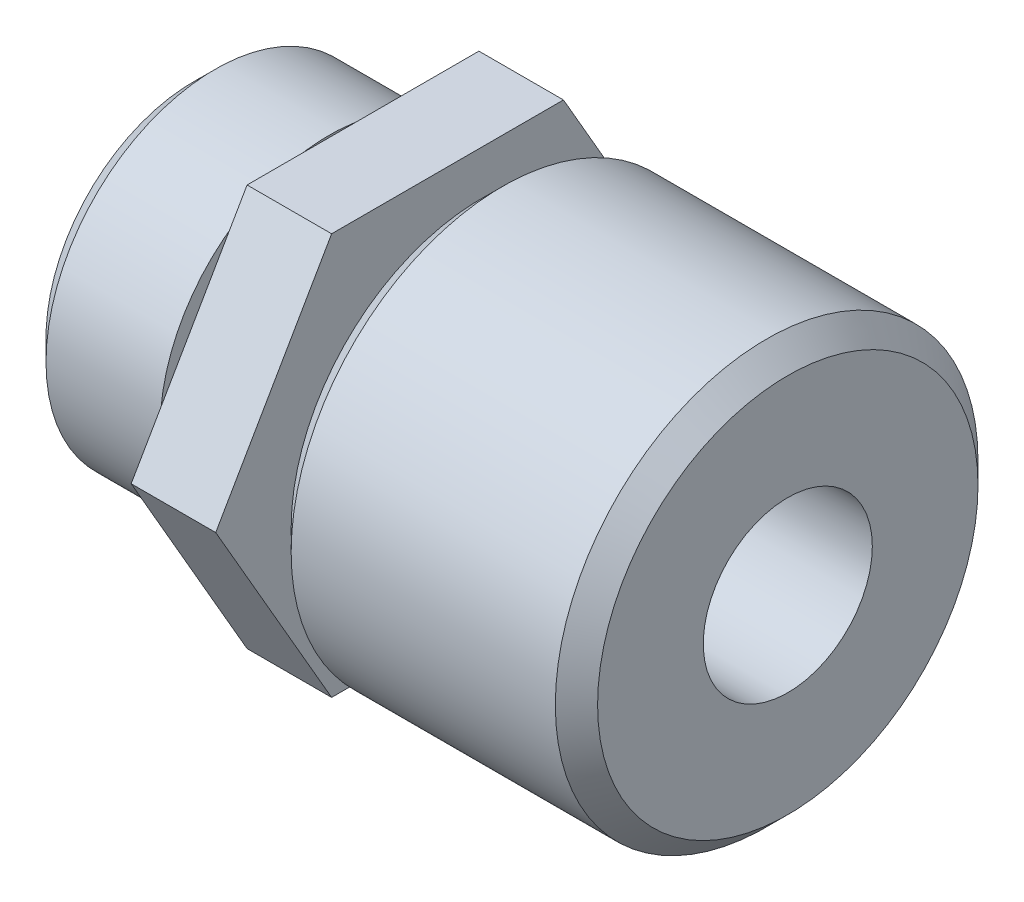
ISO-10303-21;
HEADER;
FILE_DESCRIPTION(('STEP AP214'),'2;1');
FILE_NAME('part.step','',(''),(''),'','','');
FILE_SCHEMA(('AUTOMOTIVE_DESIGN { 1 0 10303 214 1 1 1 1 }'));
ENDSEC;
DATA;
#1=APPLICATION_CONTEXT('core data for automotive mechanical design processes');
#2=APPLICATION_PROTOCOL_DEFINITION('international standard','automotive_design',2000,#1);
#3=PRODUCT_CONTEXT('',#1,'mechanical');
#4=PRODUCT('Part','Part','',(#3));
#5=PRODUCT_RELATED_PRODUCT_CATEGORY('part','',(#4));
#6=PRODUCT_DEFINITION_FORMATION('','',#4);
#7=PRODUCT_DEFINITION_CONTEXT('part definition',#1,'design');
#8=PRODUCT_DEFINITION('design','',#6,#7);
#9=PRODUCT_DEFINITION_SHAPE('','',#8);
#10=(LENGTH_UNIT() NAMED_UNIT(*) SI_UNIT(.MILLI.,.METRE.));
#11=(NAMED_UNIT(*) PLANE_ANGLE_UNIT() SI_UNIT($,.RADIAN.));
#12=(NAMED_UNIT(*) SI_UNIT($,.STERADIAN.) SOLID_ANGLE_UNIT());
#13=UNCERTAINTY_MEASURE_WITH_UNIT(LENGTH_MEASURE(1.E-05),#10,'distance_accuracy_value','');
#14=(GEOMETRIC_REPRESENTATION_CONTEXT(3) GLOBAL_UNCERTAINTY_ASSIGNED_CONTEXT((#13)) GLOBAL_UNIT_ASSIGNED_CONTEXT((#10,
#11,#12)) REPRESENTATION_CONTEXT('',''));
#15=CARTESIAN_POINT('',(0.,0.,0.));
#16=DIRECTION('',(0.,0.,1.));
#17=DIRECTION('',(1.,0.,0.));
#18=AXIS2_PLACEMENT_3D('',#15,#16,#17);
#19=CARTESIAN_POINT('',(503.662666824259,-147.707984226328,57.8));
#20=DIRECTION('',(1.,0.,0.));
#21=DIRECTION('',(0.,0.,-1.));
#22=AXIS2_PLACEMENT_3D('',#19,#20,#21);
#23=CONICAL_SURFACE('',#22,7.99999999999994,0.785398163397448);
#24=CARTESIAN_POINT('',(502.662666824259,-147.707984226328,57.8));
#25=DIRECTION('',(1.,0.,0.));
#26=DIRECTION('',(0.,0.,-1.));
#27=AXIS2_PLACEMENT_3D('',#24,#25,#26);
#28=CIRCLE('',#27,6.99999999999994);
#29=CARTESIAN_POINT('',(502.662666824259,-147.707984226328,50.8000000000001));
#30=VERTEX_POINT('',#29);
#31=EDGE_CURVE('E28',#30,#30,#28,.F.);
#32=ORIENTED_EDGE('',*,*,#31,.F.);
#33=EDGE_LOOP('',(#32));
#34=FACE_BOUND('',#33,.T.);
#35=CARTESIAN_POINT('',(503.662666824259,-147.707984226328,57.8));
#36=DIRECTION('',(-1.,0.,0.));
#37=DIRECTION('',(0.,0.,1.));
#38=AXIS2_PLACEMENT_3D('',#35,#36,#37);
#39=CIRCLE('',#38,8.);
#40=CARTESIAN_POINT('',(503.662666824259,-147.707984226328,65.8));
#41=VERTEX_POINT('',#40);
#42=EDGE_CURVE('E140',#41,#41,#39,.F.);
#43=ORIENTED_EDGE('',*,*,#42,.F.);
#44=EDGE_LOOP('',(#43));
#45=FACE_BOUND('',#44,.T.);
#46=ADVANCED_FACE('F24',(#34,#45),#23,.T.);
#47=CARTESIAN_POINT('',(502.662666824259,-147.707984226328,57.8));
#48=DIRECTION('',(-1.,0.,0.));
#49=DIRECTION('',(0.,-1.,0.));
#50=AXIS2_PLACEMENT_3D('',#47,#48,#49);
#51=PLANE('',#50);
#52=ORIENTED_EDGE('',*,*,#31,.T.);
#53=EDGE_LOOP('',(#52));
#54=FACE_BOUND('',#53,.T.);
#55=CARTESIAN_POINT('',(502.662666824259,-147.707984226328,57.8));
#56=DIRECTION('',(1.,0.,0.));
#57=DIRECTION('',(0.,0.,-1.));
#58=AXIS2_PLACEMENT_3D('',#55,#56,#57);
#59=CIRCLE('',#58,4.);
#60=CARTESIAN_POINT('',(502.662666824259,-147.707984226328,53.8));
#61=VERTEX_POINT('',#60);
#62=EDGE_CURVE('E142',#61,#61,#59,.T.);
#63=ORIENTED_EDGE('',*,*,#62,.T.);
#64=EDGE_LOOP('',(#63));
#65=FACE_BOUND('',#64,.T.);
#66=ADVANCED_FACE('F164',(#54,#65),#51,.T.);
#67=CARTESIAN_POINT('',(509.062666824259,-147.707984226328,57.8));
#68=DIRECTION('',(-1.,0.,0.));
#69=DIRECTION('',(0.,0.,1.));
#70=AXIS2_PLACEMENT_3D('',#67,#68,#69);
#71=CYLINDRICAL_SURFACE('',#70,8.);
#72=CARTESIAN_POINT('',(509.062666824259,-147.707984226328,57.8));
#73=DIRECTION('',(-1.,0.,0.));
#74=DIRECTION('',(0.,0.,1.));
#75=AXIS2_PLACEMENT_3D('',#72,#73,#74);
#76=CIRCLE('',#75,8.);
#77=CARTESIAN_POINT('',(509.062666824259,-147.707984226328,65.8));
#78=VERTEX_POINT('',#77);
#79=EDGE_CURVE('E159',#78,#78,#76,.F.);
#80=ORIENTED_EDGE('',*,*,#79,.F.);
#81=EDGE_LOOP('',(#80));
#82=FACE_BOUND('',#81,.T.);
#83=ORIENTED_EDGE('',*,*,#42,.T.);
#84=EDGE_LOOP('',(#83));
#85=FACE_BOUND('',#84,.T.);
#86=ADVANCED_FACE('F170',(#82,#85),#71,.T.);
#87=CARTESIAN_POINT('',(502.662666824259,-147.707984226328,57.8));
#88=DIRECTION('',(1.,0.,0.));
#89=DIRECTION('',(0.,0.,-1.));
#90=AXIS2_PLACEMENT_3D('',#87,#88,#89);
#91=CYLINDRICAL_SURFACE('',#90,4.);
#92=ORIENTED_EDGE('',*,*,#62,.F.);
#93=EDGE_LOOP('',(#92));
#94=FACE_BOUND('',#93,.T.);
#95=CARTESIAN_POINT('',(530.762666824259,-147.707984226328,57.8));
#96=DIRECTION('',(1.,0.,0.));
#97=DIRECTION('',(0.,0.,-1.));
#98=AXIS2_PLACEMENT_3D('',#95,#96,#97);
#99=CIRCLE('',#98,4.);
#100=CARTESIAN_POINT('',(530.762666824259,-147.707984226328,53.8));
#101=VERTEX_POINT('',#100);
#102=EDGE_CURVE('E156',#101,#101,#99,.F.);
#103=ORIENTED_EDGE('',*,*,#102,.F.);
#104=EDGE_LOOP('',(#103));
#105=FACE_BOUND('',#104,.T.);
#106=ADVANCED_FACE('F166',(#94,#105),#91,.F.);
#107=CARTESIAN_POINT('',(509.062666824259,-147.707984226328,57.8));
#108=DIRECTION('',(1.,0.,0.));
#109=DIRECTION('',(0.,0.,-1.));
#110=AXIS2_PLACEMENT_3D('',#107,#108,#109);
#111=PLANE('',#110);
#112=ORIENTED_EDGE('',*,*,#79,.T.);
#113=EDGE_LOOP('',(#112));
#114=FACE_BOUND('',#113,.T.);
#115=CARTESIAN_POINT('',(509.062666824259,-147.707984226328,57.8));
#116=DIRECTION('',(-1.,0.,0.));
#117=DIRECTION('',(0.,0.,1.));
#118=AXIS2_PLACEMENT_3D('',#115,#116,#117);
#119=CIRCLE('',#118,7.);
#120=CARTESIAN_POINT('',(509.062666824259,-147.707984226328,64.8));
#121=VERTEX_POINT('',#120);
#122=EDGE_CURVE('E153',#121,#121,#119,.F.);
#123=ORIENTED_EDGE('',*,*,#122,.F.);
#124=EDGE_LOOP('',(#123));
#125=FACE_BOUND('',#124,.T.);
#126=ADVANCED_FACE('F169',(#114,#125),#111,.T.);
#127=CARTESIAN_POINT('',(530.762666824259,-147.707984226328,57.8));
#128=DIRECTION('',(1.,0.,0.));
#129=DIRECTION('',(0.,0.,-1.));
#130=AXIS2_PLACEMENT_3D('',#127,#128,#129);
#131=PLANE('',#130);
#132=CARTESIAN_POINT('',(530.762666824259,-147.707984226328,57.8));
#133=DIRECTION('',(-1.,0.,0.));
#134=DIRECTION('',(0.,0.,1.));
#135=AXIS2_PLACEMENT_3D('',#132,#133,#134);
#136=CIRCLE('',#135,9.00000000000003);
#137=CARTESIAN_POINT('',(530.762666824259,-147.707984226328,66.8));
#138=VERTEX_POINT('',#137);
#139=EDGE_CURVE('E150',#138,#138,#136,.T.);
#140=ORIENTED_EDGE('',*,*,#139,.F.);
#141=EDGE_LOOP('',(#140));
#142=FACE_BOUND('',#141,.T.);
#143=ORIENTED_EDGE('',*,*,#102,.T.);
#144=EDGE_LOOP('',(#143));
#145=FACE_BOUND('',#144,.T.);
#146=ADVANCED_FACE('F174',(#142,#145),#131,.T.);
#147=CARTESIAN_POINT('',(510.662666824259,-147.707984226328,57.8));
#148=DIRECTION('',(-1.,0.,0.));
#149=DIRECTION('',(0.,0.,1.));
#150=AXIS2_PLACEMENT_3D('',#147,#148,#149);
#151=CYLINDRICAL_SURFACE('',#150,7.);
#152=CARTESIAN_POINT('',(510.662666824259,-147.707984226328,57.8));
#153=DIRECTION('',(-1.,0.,0.));
#154=DIRECTION('',(0.,0.,1.));
#155=AXIS2_PLACEMENT_3D('',#152,#153,#154);
#156=CIRCLE('',#155,7.);
#157=CARTESIAN_POINT('',(510.662666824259,-147.707984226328,64.8));
#158=VERTEX_POINT('',#157);
#159=EDGE_CURVE('E139',#158,#158,#156,.F.);
#160=ORIENTED_EDGE('',*,*,#159,.F.);
#161=EDGE_LOOP('',(#160));
#162=FACE_BOUND('',#161,.T.);
#163=ORIENTED_EDGE('',*,*,#122,.T.);
#164=EDGE_LOOP('',(#163));
#165=FACE_BOUND('',#164,.T.);
#166=ADVANCED_FACE('F176',(#162,#165),#151,.T.);
#167=CARTESIAN_POINT('',(529.762666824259,-147.707984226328,57.8));
#168=DIRECTION('',(-1.,0.,0.));
#169=DIRECTION('',(0.,0.,1.));
#170=AXIS2_PLACEMENT_3D('',#167,#168,#169);
#171=CONICAL_SURFACE('',#170,10.0000000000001,0.785398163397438);
#172=CARTESIAN_POINT('',(529.762666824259,-147.707984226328,57.8));
#173=DIRECTION('',(1.,0.,0.));
#174=DIRECTION('',(0.,0.,-1.));
#175=AXIS2_PLACEMENT_3D('',#172,#173,#174);
#176=CIRCLE('',#175,10.);
#177=CARTESIAN_POINT('',(529.762666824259,-147.707984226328,47.8));
#178=VERTEX_POINT('',#177);
#179=EDGE_CURVE('E91',#178,#178,#176,.F.);
#180=ORIENTED_EDGE('',*,*,#179,.F.);
#181=EDGE_LOOP('',(#180));
#182=FACE_BOUND('',#181,.T.);
#183=ORIENTED_EDGE('',*,*,#139,.T.);
#184=EDGE_LOOP('',(#183));
#185=FACE_BOUND('',#184,.T.);
#186=ADVANCED_FACE('F184',(#182,#185),#171,.T.);
#187=CARTESIAN_POINT('',(510.662666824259,-147.707984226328,57.8));
#188=DIRECTION('',(-1.,0.,0.));
#189=DIRECTION('',(0.,-1.,0.));
#190=AXIS2_PLACEMENT_3D('',#187,#188,#189);
#191=PLANE('',#190);
#192=DIRECTION('',(0.,0.,-1.));
#193=VECTOR('',#192,1.);
#194=CARTESIAN_POINT('',(510.662666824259,-157.207984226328,52.3151724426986));
#195=LINE('',#194,#193);
#196=CARTESIAN_POINT('',(510.662666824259,-157.207984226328,63.2848275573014));
#197=VERTEX_POINT('',#196);
#198=CARTESIAN_POINT('',(510.662666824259,-157.207984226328,52.3151724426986));
#199=VERTEX_POINT('',#198);
#200=EDGE_CURVE('E100',#197,#199,#195,.T.);
#201=ORIENTED_EDGE('',*,*,#200,.F.);
#202=DIRECTION('',(0.,-0.866025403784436,-0.500000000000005));
#203=VECTOR('',#202,1.);
#204=CARTESIAN_POINT('',(510.662666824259,-157.207984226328,63.2848275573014));
#205=LINE('',#204,#203);
#206=CARTESIAN_POINT('',(510.662666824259,-147.707984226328,68.7696551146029));
#207=VERTEX_POINT('',#206);
#208=EDGE_CURVE('E109',#207,#197,#205,.T.);
#209=ORIENTED_EDGE('',*,*,#208,.F.);
#210=DIRECTION('',(0.,-0.866025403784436,0.500000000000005));
#211=VECTOR('',#210,1.);
#212=CARTESIAN_POINT('',(510.662666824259,-147.707984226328,68.7696551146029));
#213=LINE('',#212,#211);
#214=CARTESIAN_POINT('',(510.662666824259,-138.207984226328,63.2848275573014));
#215=VERTEX_POINT('',#214);
#216=EDGE_CURVE('E70',#215,#207,#213,.T.);
#217=ORIENTED_EDGE('',*,*,#216,.F.);
#218=DIRECTION('',(0.,0.,1.));
#219=VECTOR('',#218,1.);
#220=CARTESIAN_POINT('',(510.662666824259,-138.207984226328,63.2848275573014));
#221=LINE('',#220,#219);
#222=CARTESIAN_POINT('',(510.662666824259,-138.207984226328,52.3151724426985));
#223=VERTEX_POINT('',#222);
#224=EDGE_CURVE('E90',#223,#215,#221,.T.);
#225=ORIENTED_EDGE('',*,*,#224,.F.);
#226=DIRECTION('',(0.,0.86602540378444,0.499999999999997));
#227=VECTOR('',#226,1.);
#228=CARTESIAN_POINT('',(510.662666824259,-138.207984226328,52.3151724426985));
#229=LINE('',#228,#227);
#230=CARTESIAN_POINT('',(510.662666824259,-147.707984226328,46.8303448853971));
#231=VERTEX_POINT('',#230);
#232=EDGE_CURVE('E82',#231,#223,#229,.T.);
#233=ORIENTED_EDGE('',*,*,#232,.F.);
#234=DIRECTION('',(0.,0.866025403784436,-0.500000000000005));
#235=VECTOR('',#234,1.);
#236=CARTESIAN_POINT('',(510.662666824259,-147.707984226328,46.8303448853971));
#237=LINE('',#236,#235);
#238=EDGE_CURVE('E87',#199,#231,#237,.T.);
#239=ORIENTED_EDGE('',*,*,#238,.F.);
#240=EDGE_LOOP('',(#201,#209,#217,#225,#233,#239));
#241=FACE_BOUND('',#240,.T.);
#242=ORIENTED_EDGE('',*,*,#159,.T.);
#243=EDGE_LOOP('',(#242));
#244=FACE_BOUND('',#243,.T.);
#245=ADVANCED_FACE('F84',(#241,#244),#191,.T.);
#246=CARTESIAN_POINT('',(517.262666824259,-147.707984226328,57.8));
#247=DIRECTION('',(1.,0.,0.));
#248=DIRECTION('',(0.,0.,-1.));
#249=AXIS2_PLACEMENT_3D('',#246,#247,#248);
#250=CYLINDRICAL_SURFACE('',#249,10.);
#251=ORIENTED_EDGE('',*,*,#179,.T.);
#252=EDGE_LOOP('',(#251));
#253=FACE_BOUND('',#252,.T.);
#254=CARTESIAN_POINT('',(517.262666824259,-147.707984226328,57.8));
#255=DIRECTION('',(1.,0.,0.));
#256=DIRECTION('',(0.,0.,1.));
#257=AXIS2_PLACEMENT_3D('',#254,#255,#256);
#258=CIRCLE('',#257,10.);
#259=CARTESIAN_POINT('',(517.262666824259,-147.707984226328,67.8));
#260=VERTEX_POINT('',#259);
#261=EDGE_CURVE('E121',#260,#260,#258,.F.);
#262=ORIENTED_EDGE('',*,*,#261,.F.);
#263=EDGE_LOOP('',(#262));
#264=FACE_BOUND('',#263,.T.);
#265=ADVANCED_FACE('F241',(#253,#264),#250,.T.);
#266=CARTESIAN_POINT('',(510.662666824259,-138.207984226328,52.3151724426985));
#267=DIRECTION('',(0.,0.499999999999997,-0.86602540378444));
#268=DIRECTION('',(0.,0.86602540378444,0.499999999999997));
#269=AXIS2_PLACEMENT_3D('',#266,#267,#268);
#270=PLANE('',#269);
#271=ORIENTED_EDGE('',*,*,#232,.T.);
#272=DIRECTION('',(1.,0.,0.));
#273=VECTOR('',#272,1.);
#274=CARTESIAN_POINT('',(510.662666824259,-138.207984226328,52.3151724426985));
#275=LINE('',#274,#273);
#276=CARTESIAN_POINT('',(514.662666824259,-138.207984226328,52.3151724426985));
#277=VERTEX_POINT('',#276);
#278=EDGE_CURVE('E63',#277,#223,#275,.F.);
#279=ORIENTED_EDGE('',*,*,#278,.F.);
#280=DIRECTION('',(0.,-0.86602540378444,-0.499999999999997));
#281=VECTOR('',#280,1.);
#282=CARTESIAN_POINT('',(514.662666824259,-138.207984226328,52.3151724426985));
#283=LINE('',#282,#281);
#284=CARTESIAN_POINT('',(514.662666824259,-147.707984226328,46.8303448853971));
#285=VERTEX_POINT('',#284);
#286=EDGE_CURVE('E97',#277,#285,#283,.T.);
#287=ORIENTED_EDGE('',*,*,#286,.T.);
#288=DIRECTION('',(1.,0.,0.));
#289=VECTOR('',#288,1.);
#290=CARTESIAN_POINT('',(510.662666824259,-147.707984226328,46.8303448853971));
#291=LINE('',#290,#289);
#292=EDGE_CURVE('E94',#231,#285,#291,.T.);
#293=ORIENTED_EDGE('',*,*,#292,.F.);
#294=EDGE_LOOP('',(#271,#279,#287,#293));
#295=FACE_BOUND('',#294,.T.);
#296=ADVANCED_FACE('F95',(#295),#270,.T.);
#297=CARTESIAN_POINT('',(510.662666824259,-147.707984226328,46.8303448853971));
#298=DIRECTION('',(0.,-0.500000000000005,-0.866025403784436));
#299=DIRECTION('',(0.,0.866025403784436,-0.500000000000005));
#300=AXIS2_PLACEMENT_3D('',#297,#298,#299);
#301=PLANE('',#300);
#302=ORIENTED_EDGE('',*,*,#238,.T.);
#303=ORIENTED_EDGE('',*,*,#292,.T.);
#304=DIRECTION('',(0.,-0.866025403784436,0.500000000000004));
#305=VECTOR('',#304,1.);
#306=CARTESIAN_POINT('',(514.662666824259,-147.707984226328,46.8303448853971));
#307=LINE('',#306,#305);
#308=CARTESIAN_POINT('',(514.662666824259,-157.207984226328,52.3151724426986));
#309=VERTEX_POINT('',#308);
#310=EDGE_CURVE('E132',#285,#309,#307,.T.);
#311=ORIENTED_EDGE('',*,*,#310,.T.);
#312=DIRECTION('',(1.,0.,0.));
#313=VECTOR('',#312,1.);
#314=CARTESIAN_POINT('',(510.662666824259,-157.207984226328,52.3151724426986));
#315=LINE('',#314,#313);
#316=EDGE_CURVE('E104',#199,#309,#315,.T.);
#317=ORIENTED_EDGE('',*,*,#316,.F.);
#318=EDGE_LOOP('',(#302,#303,#311,#317));
#319=FACE_BOUND('',#318,.T.);
#320=ADVANCED_FACE('F102',(#319),#301,.T.);
#321=CARTESIAN_POINT('',(510.662666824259,-157.207984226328,52.3151724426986));
#322=DIRECTION('',(0.,-1.,0.));
#323=DIRECTION('',(0.,0.,-1.));
#324=AXIS2_PLACEMENT_3D('',#321,#322,#323);
#325=PLANE('',#324);
#326=ORIENTED_EDGE('',*,*,#200,.T.);
#327=ORIENTED_EDGE('',*,*,#316,.T.);
#328=DIRECTION('',(0.,0.,1.));
#329=VECTOR('',#328,1.);
#330=CARTESIAN_POINT('',(514.662666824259,-157.207984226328,63.2848275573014));
#331=LINE('',#330,#329);
#332=CARTESIAN_POINT('',(514.662666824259,-157.207984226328,63.2848275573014));
#333=VERTEX_POINT('',#332);
#334=EDGE_CURVE('E130',#309,#333,#331,.T.);
#335=ORIENTED_EDGE('',*,*,#334,.T.);
#336=DIRECTION('',(1.,0.,0.));
#337=VECTOR('',#336,1.);
#338=CARTESIAN_POINT('',(510.662666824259,-157.207984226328,63.2848275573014));
#339=LINE('',#338,#337);
#340=EDGE_CURVE('E111',#197,#333,#339,.T.);
#341=ORIENTED_EDGE('',*,*,#340,.F.);
#342=EDGE_LOOP('',(#326,#327,#335,#341));
#343=FACE_BOUND('',#342,.T.);
#344=ADVANCED_FACE('F218',(#343),#325,.T.);
#345=CARTESIAN_POINT('',(510.662666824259,-157.207984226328,63.2848275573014));
#346=DIRECTION('',(0.,-0.500000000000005,0.866025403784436));
#347=DIRECTION('',(0.,-0.866025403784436,-0.500000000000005));
#348=AXIS2_PLACEMENT_3D('',#345,#346,#347);
#349=PLANE('',#348);
#350=ORIENTED_EDGE('',*,*,#208,.T.);
#351=ORIENTED_EDGE('',*,*,#340,.T.);
#352=DIRECTION('',(0.,0.866025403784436,0.500000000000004));
#353=VECTOR('',#352,1.);
#354=CARTESIAN_POINT('',(514.662666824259,-157.207984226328,63.2848275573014));
#355=LINE('',#354,#353);
#356=CARTESIAN_POINT('',(514.662666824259,-147.707984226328,68.7696551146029));
#357=VERTEX_POINT('',#356);
#358=EDGE_CURVE('E128',#333,#357,#355,.T.);
#359=ORIENTED_EDGE('',*,*,#358,.T.);
#360=DIRECTION('',(1.,0.,0.));
#361=VECTOR('',#360,1.);
#362=CARTESIAN_POINT('',(510.662666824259,-147.707984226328,68.7696551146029));
#363=LINE('',#362,#361);
#364=EDGE_CURVE('E116',#207,#357,#363,.T.);
#365=ORIENTED_EDGE('',*,*,#364,.F.);
#366=EDGE_LOOP('',(#350,#351,#359,#365));
#367=FACE_BOUND('',#366,.T.);
#368=ADVANCED_FACE('F215',(#367),#349,.T.);
#369=CARTESIAN_POINT('',(510.662666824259,-147.707984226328,68.7696551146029));
#370=DIRECTION('',(0.,0.500000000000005,0.866025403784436));
#371=DIRECTION('',(0.,-0.866025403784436,0.500000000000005));
#372=AXIS2_PLACEMENT_3D('',#369,#370,#371);
#373=PLANE('',#372);
#374=ORIENTED_EDGE('',*,*,#216,.T.);
#375=ORIENTED_EDGE('',*,*,#364,.T.);
#376=DIRECTION('',(0.,0.866025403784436,-0.500000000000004));
#377=VECTOR('',#376,1.);
#378=CARTESIAN_POINT('',(514.662666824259,-147.707984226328,68.7696551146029));
#379=LINE('',#378,#377);
#380=CARTESIAN_POINT('',(514.662666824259,-138.207984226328,63.2848275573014));
#381=VERTEX_POINT('',#380);
#382=EDGE_CURVE('E43',#357,#381,#379,.T.);
#383=ORIENTED_EDGE('',*,*,#382,.T.);
#384=DIRECTION('',(1.,0.,0.));
#385=VECTOR('',#384,1.);
#386=CARTESIAN_POINT('',(510.662666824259,-138.207984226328,63.2848275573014));
#387=LINE('',#386,#385);
#388=EDGE_CURVE('E119',#215,#381,#387,.T.);
#389=ORIENTED_EDGE('',*,*,#388,.F.);
#390=EDGE_LOOP('',(#374,#375,#383,#389));
#391=FACE_BOUND('',#390,.T.);
#392=ADVANCED_FACE('F212',(#391),#373,.T.);
#393=CARTESIAN_POINT('',(510.662666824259,-138.207984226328,63.2848275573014));
#394=DIRECTION('',(0.,1.,0.));
#395=DIRECTION('',(0.,0.,1.));
#396=AXIS2_PLACEMENT_3D('',#393,#394,#395);
#397=PLANE('',#396);
#398=ORIENTED_EDGE('',*,*,#224,.T.);
#399=ORIENTED_EDGE('',*,*,#388,.T.);
#400=DIRECTION('',(0.,0.,1.));
#401=VECTOR('',#400,1.);
#402=CARTESIAN_POINT('',(514.662666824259,-138.207984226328,63.2848275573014));
#403=LINE('',#402,#401);
#404=EDGE_CURVE('E124',#381,#277,#403,.F.);
#405=ORIENTED_EDGE('',*,*,#404,.T.);
#406=ORIENTED_EDGE('',*,*,#278,.T.);
#407=EDGE_LOOP('',(#398,#399,#405,#406));
#408=FACE_BOUND('',#407,.T.);
#409=ADVANCED_FACE('F211',(#408),#397,.T.);
#410=CARTESIAN_POINT('',(517.262666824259,-147.707984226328,57.8));
#411=DIRECTION('',(1.,0.,0.));
#412=DIRECTION('',(0.,0.,-1.));
#413=AXIS2_PLACEMENT_3D('',#410,#411,#412);
#414=CONICAL_SURFACE('',#413,10.0000000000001,0.785398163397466);
#415=CARTESIAN_POINT('',(516.262666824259,-147.707984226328,57.8));
#416=DIRECTION('',(1.,0.,0.));
#417=DIRECTION('',(0.,0.,-1.));
#418=AXIS2_PLACEMENT_3D('',#415,#416,#417);
#419=CIRCLE('',#418,9.00000000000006);
#420=CARTESIAN_POINT('',(516.262666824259,-147.707984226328,48.7999999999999));
#421=VERTEX_POINT('',#420);
#422=EDGE_CURVE('E126',#421,#421,#419,.F.);
#423=ORIENTED_EDGE('',*,*,#422,.F.);
#424=EDGE_LOOP('',(#423));
#425=FACE_BOUND('',#424,.T.);
#426=ORIENTED_EDGE('',*,*,#261,.T.);
#427=EDGE_LOOP('',(#426));
#428=FACE_BOUND('',#427,.T.);
#429=ADVANCED_FACE('F205',(#425,#428),#414,.T.);
#430=CARTESIAN_POINT('',(514.662666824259,-138.207984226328,63.2848275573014));
#431=DIRECTION('',(-1.,0.,0.));
#432=DIRECTION('',(0.,-1.,0.));
#433=AXIS2_PLACEMENT_3D('',#430,#431,#432);
#434=PLANE('',#433);
#435=CARTESIAN_POINT('',(514.662666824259,-147.707984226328,57.8));
#436=DIRECTION('',(1.,0.,0.));
#437=DIRECTION('',(0.,0.,-1.));
#438=AXIS2_PLACEMENT_3D('',#435,#436,#437);
#439=CIRCLE('',#438,5.);
#440=CARTESIAN_POINT('',(514.662666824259,-147.707984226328,52.8));
#441=VERTEX_POINT('',#440);
#442=EDGE_CURVE('E34',#441,#441,#439,.T.);
#443=ORIENTED_EDGE('',*,*,#442,.F.);
#444=EDGE_LOOP('',(#443));
#445=FACE_BOUND('',#444,.T.);
#446=ORIENTED_EDGE('',*,*,#382,.F.);
#447=ORIENTED_EDGE('',*,*,#358,.F.);
#448=ORIENTED_EDGE('',*,*,#334,.F.);
#449=ORIENTED_EDGE('',*,*,#310,.F.);
#450=ORIENTED_EDGE('',*,*,#286,.F.);
#451=ORIENTED_EDGE('',*,*,#404,.F.);
#452=EDGE_LOOP('',(#446,#447,#448,#449,#450,#451));
#453=FACE_BOUND('',#452,.T.);
#454=ADVANCED_FACE('F196',(#445,#453),#434,.F.);
#455=CARTESIAN_POINT('',(516.262666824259,-147.707984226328,57.8));
#456=DIRECTION('',(-1.,0.,0.));
#457=DIRECTION('',(0.,-1.,0.));
#458=AXIS2_PLACEMENT_3D('',#455,#456,#457);
#459=PLANE('',#458);
#460=ORIENTED_EDGE('',*,*,#422,.T.);
#461=EDGE_LOOP('',(#460));
#462=FACE_BOUND('',#461,.T.);
#463=CARTESIAN_POINT('',(516.262666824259,-147.707984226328,57.8));
#464=DIRECTION('',(1.,0.,0.));
#465=DIRECTION('',(0.,0.,-1.));
#466=AXIS2_PLACEMENT_3D('',#463,#464,#465);
#467=CIRCLE('',#466,5.);
#468=CARTESIAN_POINT('',(516.262666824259,-147.707984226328,52.8));
#469=VERTEX_POINT('',#468);
#470=EDGE_CURVE('E13',#469,#469,#467,.F.);
#471=ORIENTED_EDGE('',*,*,#470,.F.);
#472=EDGE_LOOP('',(#471));
#473=FACE_BOUND('',#472,.T.);
#474=ADVANCED_FACE('F191',(#462,#473),#459,.T.);
#475=CARTESIAN_POINT('',(514.662666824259,-147.707984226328,57.8));
#476=DIRECTION('',(1.,0.,0.));
#477=DIRECTION('',(0.,0.,-1.));
#478=AXIS2_PLACEMENT_3D('',#475,#476,#477);
#479=CYLINDRICAL_SURFACE('',#478,5.);
#480=ORIENTED_EDGE('',*,*,#442,.T.);
#481=EDGE_LOOP('',(#480));
#482=FACE_BOUND('',#481,.T.);
#483=ORIENTED_EDGE('',*,*,#470,.T.);
#484=EDGE_LOOP('',(#483));
#485=FACE_BOUND('',#484,.T.);
#486=ADVANCED_FACE('F26',(#482,#485),#479,.T.);
#487=CLOSED_SHELL('',(#46,#66,#86,#106,#126,#146,#166,#186,#245,#265,#296,#320,#344,#368,#392,
#409,#429,#454,#474,#486));
#488=MANIFOLD_SOLID_BREP('B1',#487);
#489=ADVANCED_BREP_SHAPE_REPRESENTATION('',(#18,#488),#14);
#490=SHAPE_DEFINITION_REPRESENTATION(#9,#489);
ENDSEC;
END-ISO-10303-21;
